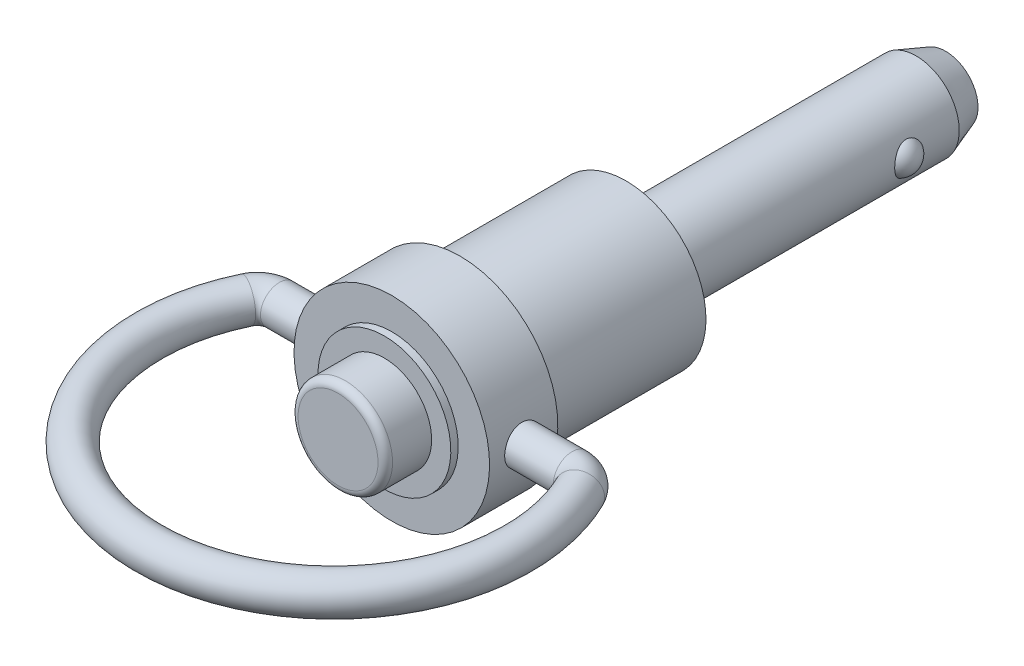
ISO-10303-21;
HEADER;
FILE_DESCRIPTION(('STEP AP214'),'2;1');
FILE_NAME('part.step','',(''),(''),'','','');
FILE_SCHEMA(('AUTOMOTIVE_DESIGN { 1 0 10303 214 1 1 1 1 }'));
ENDSEC;
DATA;
#1=APPLICATION_CONTEXT('core data for automotive mechanical design processes');
#2=APPLICATION_PROTOCOL_DEFINITION('international standard','automotive_design',2000,#1);
#3=PRODUCT_CONTEXT('',#1,'mechanical');
#4=PRODUCT('Part','Part','',(#3));
#5=PRODUCT_RELATED_PRODUCT_CATEGORY('part','',(#4));
#6=PRODUCT_DEFINITION_FORMATION('','',#4);
#7=PRODUCT_DEFINITION_CONTEXT('part definition',#1,'design');
#8=PRODUCT_DEFINITION('design','',#6,#7);
#9=PRODUCT_DEFINITION_SHAPE('','',#8);
#10=(LENGTH_UNIT() NAMED_UNIT(*) SI_UNIT(.MILLI.,.METRE.));
#11=(NAMED_UNIT(*) PLANE_ANGLE_UNIT() SI_UNIT($,.RADIAN.));
#12=(NAMED_UNIT(*) SI_UNIT($,.STERADIAN.) SOLID_ANGLE_UNIT());
#13=UNCERTAINTY_MEASURE_WITH_UNIT(LENGTH_MEASURE(1.E-05),#10,'distance_accuracy_value','');
#14=(GEOMETRIC_REPRESENTATION_CONTEXT(3) GLOBAL_UNCERTAINTY_ASSIGNED_CONTEXT((#13)) GLOBAL_UNIT_ASSIGNED_CONTEXT((#10,
#11,#12)) REPRESENTATION_CONTEXT('',''));
#15=CARTESIAN_POINT('',(0.,0.,0.));
#16=DIRECTION('',(0.,0.,1.));
#17=DIRECTION('',(1.,0.,0.));
#18=AXIS2_PLACEMENT_3D('',#15,#16,#17);
#19=CARTESIAN_POINT('',(0.,0.,20.828));
#20=DIRECTION('',(0.,0.,-1.));
#21=DIRECTION('',(0.,1.,0.));
#22=AXIS2_PLACEMENT_3D('',#19,#20,#21);
#23=CYLINDRICAL_SURFACE('',#22,3.2512);
#24=CARTESIAN_POINT('',(0.,0.,16.637));
#25=DIRECTION('',(0.,0.,-1.));
#26=DIRECTION('',(0.,1.,0.));
#27=AXIS2_PLACEMENT_3D('',#24,#25,#26);
#28=CIRCLE('',#27,3.2512);
#29=CARTESIAN_POINT('',(0.,3.2512,16.637));
#30=VERTEX_POINT('',#29);
#31=EDGE_CURVE('E30',#30,#30,#28,.T.);
#32=ORIENTED_EDGE('',*,*,#31,.F.);
#33=EDGE_LOOP('',(#32));
#34=FACE_BOUND('',#33,.T.);
#35=CARTESIAN_POINT('',(0.,0.,19.328));
#36=DIRECTION('',(0.,0.,1.));
#37=DIRECTION('',(1.,0.,0.));
#38=AXIS2_PLACEMENT_3D('',#35,#36,#37);
#39=CIRCLE('',#38,3.2512);
#40=CARTESIAN_POINT('',(3.2512,0.,19.328));
#41=VERTEX_POINT('',#40);
#42=EDGE_CURVE('E136',#41,#41,#39,.T.);
#43=ORIENTED_EDGE('',*,*,#42,.F.);
#44=EDGE_LOOP('',(#43));
#45=FACE_BOUND('',#44,.T.);
#46=ADVANCED_FACE('F12',(#34,#45),#23,.T.);
#47=CARTESIAN_POINT('',(4.572,0.,16.637));
#48=DIRECTION('',(0.,0.,1.));
#49=DIRECTION('',(0.,-1.,0.));
#50=AXIS2_PLACEMENT_3D('',#47,#48,#49);
#51=PLANE('',#50);
#52=ORIENTED_EDGE('',*,*,#31,.T.);
#53=EDGE_LOOP('',(#52));
#54=FACE_BOUND('',#53,.T.);
#55=CARTESIAN_POINT('',(0.,0.,16.637));
#56=DIRECTION('',(0.,0.,-1.));
#57=DIRECTION('',(0.,1.,0.));
#58=AXIS2_PLACEMENT_3D('',#55,#56,#57);
#59=CIRCLE('',#58,4.572);
#60=CARTESIAN_POINT('',(0.,4.572,16.637));
#61=VERTEX_POINT('',#60);
#62=EDGE_CURVE('E35',#61,#61,#59,.T.);
#63=ORIENTED_EDGE('',*,*,#62,.F.);
#64=EDGE_LOOP('',(#63));
#65=FACE_BOUND('',#64,.T.);
#66=ADVANCED_FACE('F78',(#54,#65),#51,.T.);
#67=CARTESIAN_POINT('',(0.,0.,0.));
#68=DIRECTION('',(0.,0.,-1.));
#69=DIRECTION('',(0.,1.,0.));
#70=AXIS2_PLACEMENT_3D('',#67,#68,#69);
#71=CYLINDRICAL_SURFACE('',#70,4.572);
#72=ORIENTED_EDGE('',*,*,#62,.T.);
#73=EDGE_LOOP('',(#72));
#74=FACE_BOUND('',#73,.T.);
#75=CARTESIAN_POINT('',(0.,0.,16.129));
#76=DIRECTION('',(0.,0.,-1.));
#77=DIRECTION('',(0.,1.,0.));
#78=AXIS2_PLACEMENT_3D('',#75,#76,#77);
#79=CIRCLE('',#78,4.572);
#80=CARTESIAN_POINT('',(0.,4.572,16.129));
#81=VERTEX_POINT('',#80);
#82=EDGE_CURVE('E38',#81,#81,#79,.T.);
#83=ORIENTED_EDGE('',*,*,#82,.F.);
#84=EDGE_LOOP('',(#83));
#85=FACE_BOUND('',#84,.T.);
#86=ADVANCED_FACE('F155',(#74,#85),#71,.T.);
#87=CARTESIAN_POINT('',(6.731,0.,16.129));
#88=DIRECTION('',(0.,0.,1.));
#89=DIRECTION('',(0.,-1.,0.));
#90=AXIS2_PLACEMENT_3D('',#87,#88,#89);
#91=PLANE('',#90);
#92=CARTESIAN_POINT('',(0.,0.,16.129));
#93=DIRECTION('',(0.,0.,-1.));
#94=DIRECTION('',(0.,1.,0.));
#95=AXIS2_PLACEMENT_3D('',#92,#93,#94);
#96=CIRCLE('',#95,6.731);
#97=CARTESIAN_POINT('',(0.,6.731,16.129));
#98=VERTEX_POINT('',#97);
#99=EDGE_CURVE('E41',#98,#98,#96,.T.);
#100=ORIENTED_EDGE('',*,*,#99,.F.);
#101=EDGE_LOOP('',(#100));
#102=FACE_BOUND('',#101,.T.);
#103=ORIENTED_EDGE('',*,*,#82,.T.);
#104=EDGE_LOOP('',(#103));
#105=FACE_BOUND('',#104,.T.);
#106=ADVANCED_FACE('F196',(#102,#105),#91,.T.);
#107=CARTESIAN_POINT('',(0.,0.,0.));
#108=DIRECTION('',(0.,0.,-1.));
#109=DIRECTION('',(0.,1.,0.));
#110=AXIS2_PLACEMENT_3D('',#107,#108,#109);
#111=CYLINDRICAL_SURFACE('',#110,6.731);
#112=CARTESIAN_POINT('',(0.,0.,11.43));
#113=DIRECTION('',(0.,0.,-1.));
#114=DIRECTION('',(0.,1.,0.));
#115=AXIS2_PLACEMENT_3D('',#112,#113,#114);
#116=CIRCLE('',#115,6.731);
#117=CARTESIAN_POINT('',(0.,6.731,11.43));
#118=VERTEX_POINT('',#117);
#119=EDGE_CURVE('E44',#118,#118,#116,.T.);
#120=ORIENTED_EDGE('',*,*,#119,.F.);
#121=EDGE_LOOP('',(#120));
#122=FACE_BOUND('',#121,.T.);
#123=ORIENTED_EDGE('',*,*,#99,.T.);
#124=EDGE_LOOP('',(#123));
#125=FACE_BOUND('',#124,.T.);
#126=CARTESIAN_POINT('',(-6.6051722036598,1.2954,13.7922));
#127=CARTESIAN_POINT('',(-6.60517361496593,1.2953972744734,13.864236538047));
#128=CARTESIAN_POINT('',(-6.60636346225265,1.28937073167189,13.9363080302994));
#129=CARTESIAN_POINT('',(-6.61098794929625,1.26544153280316,14.0784162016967));
#130=CARTESIAN_POINT('',(-6.61442445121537,1.24752902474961,14.1484511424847));
#131=CARTESIAN_POINT('',(-6.62313895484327,1.20040052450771,14.2844095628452));
#132=CARTESIAN_POINT('',(-6.62841519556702,1.17119533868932,14.3503369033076));
#133=CARTESIAN_POINT('',(-6.64021258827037,1.10233951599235,14.4763528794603));
#134=CARTESIAN_POINT('',(-6.64673365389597,1.06268960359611,14.5364419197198));
#135=CARTESIAN_POINT('',(-6.66038139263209,0.973516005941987,14.6498669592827));
#136=CARTESIAN_POINT('',(-6.66751428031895,0.9238817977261,14.7031153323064));
#137=CARTESIAN_POINT('',(-6.68152715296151,0.816387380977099,14.8005834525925));
#138=CARTESIAN_POINT('',(-6.6884071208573,0.758526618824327,14.8448025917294));
#139=CARTESIAN_POINT('',(-6.7012057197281,0.635644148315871,14.9232944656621));
#140=CARTESIAN_POINT('',(-6.70711617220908,0.570568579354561,14.9574843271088));
#141=CARTESIAN_POINT('',(-6.71724013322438,0.435464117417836,15.014412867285));
#142=CARTESIAN_POINT('',(-6.72145378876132,0.365435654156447,15.0371525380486));
#143=CARTESIAN_POINT('',(-6.72766549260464,0.223321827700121,15.0702635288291));
#144=CARTESIAN_POINT('',(-6.72968999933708,0.151272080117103,15.0807826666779));
#145=CARTESIAN_POINT('',(-6.73138656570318,0.00640388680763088,15.089614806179));
#146=CARTESIAN_POINT('',(-6.73105883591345,-0.0664144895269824,15.0879289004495));
#147=CARTESIAN_POINT('',(-6.72810846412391,-0.209738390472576,15.072511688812));
#148=CARTESIAN_POINT('',(-6.72551615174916,-0.280261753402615,15.0589395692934));
#149=CARTESIAN_POINT('',(-6.71836197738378,-0.418011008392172,15.0203872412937));
#150=CARTESIAN_POINT('',(-6.71380004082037,-0.485236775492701,14.9954066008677));
#151=CARTESIAN_POINT('',(-6.70316878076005,-0.614941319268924,14.9345963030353));
#152=CARTESIAN_POINT('',(-6.69709072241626,-0.67738974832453,14.8987035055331));
#153=CARTESIAN_POINT('',(-6.68409856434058,-0.795436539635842,14.8171343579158));
#154=CARTESIAN_POINT('',(-6.677184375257,-0.851034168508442,14.7714569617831));
#155=CARTESIAN_POINT('',(-6.66315320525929,-0.954744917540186,14.6707395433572));
#156=CARTESIAN_POINT('',(-6.65603475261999,-1.00272266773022,14.6155602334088));
#157=CARTESIAN_POINT('',(-6.64250376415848,-1.08876420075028,14.4978679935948));
#158=CARTESIAN_POINT('',(-6.63609123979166,-1.12682782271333,14.4353549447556));
#159=CARTESIAN_POINT('',(-6.62469571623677,-1.19200234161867,14.3045844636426));
#160=CARTESIAN_POINT('',(-6.61971540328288,-1.21909269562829,14.2363165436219));
#161=CARTESIAN_POINT('',(-6.61178862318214,-1.26138008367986,14.0960804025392));
#162=CARTESIAN_POINT('',(-6.60884191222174,-1.27657854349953,14.0241126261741));
#163=CARTESIAN_POINT('',(-6.60536444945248,-1.29445125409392,13.8797427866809));
#164=CARTESIAN_POINT('',(-6.60479610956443,-1.29732037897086,13.8073657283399));
#165=CARTESIAN_POINT('',(-6.60603903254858,-1.29097613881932,13.6631669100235));
#166=CARTESIAN_POINT('',(-6.60785017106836,-1.28176340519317,13.5913451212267));
#167=CARTESIAN_POINT('',(-6.6136128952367,-1.25168453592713,13.4509418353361));
#168=CARTESIAN_POINT('',(-6.61754556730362,-1.23092132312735,13.3823374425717));
#169=CARTESIAN_POINT('',(-6.62709183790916,-1.17844042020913,13.249581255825));
#170=CARTESIAN_POINT('',(-6.63270556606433,-1.14672188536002,13.1854298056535));
#171=CARTESIAN_POINT('',(-6.6450665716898,-1.07278507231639,13.0625442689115));
#172=CARTESIAN_POINT('',(-6.65182676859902,-1.03044414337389,13.0038853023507));
#173=CARTESIAN_POINT('',(-6.66568301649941,-0.936629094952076,12.8944341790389));
#174=CARTESIAN_POINT('',(-6.67277909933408,-0.885154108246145,12.8436427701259));
#175=CARTESIAN_POINT('',(-6.68662882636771,-0.773660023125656,12.7506362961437));
#176=CARTESIAN_POINT('',(-6.69337621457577,-0.713530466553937,12.7085525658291));
#177=CARTESIAN_POINT('',(-6.70566168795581,-0.586941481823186,12.6350847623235));
#178=CARTESIAN_POINT('',(-6.71119982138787,-0.520482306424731,12.6037002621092));
#179=CARTESIAN_POINT('',(-6.72041595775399,-0.383476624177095,12.5527164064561));
#180=CARTESIAN_POINT('',(-6.72410395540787,-0.312954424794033,12.5330536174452));
#181=CARTESIAN_POINT('',(-6.72924701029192,-0.169530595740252,12.5058694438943));
#182=CARTESIAN_POINT('',(-6.7307023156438,-0.0966292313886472,12.4983467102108));
#183=CARTESIAN_POINT('',(-6.73121071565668,0.0482259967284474,12.4957052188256));
#184=CARTESIAN_POINT('',(-6.73030215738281,0.120176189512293,12.5003884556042));
#185=CARTESIAN_POINT('',(-6.72626496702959,0.26224403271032,12.5215909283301));
#186=CARTESIAN_POINT('',(-6.72313635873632,0.332361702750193,12.5381100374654));
#187=CARTESIAN_POINT('',(-6.71501101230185,0.468662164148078,12.5824301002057));
#188=CARTESIAN_POINT('',(-6.710017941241,0.534852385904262,12.6102089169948));
#189=CARTESIAN_POINT('',(-6.69870305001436,0.661661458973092,12.6762356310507));
#190=CARTESIAN_POINT('',(-6.69238113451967,0.722279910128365,12.7144842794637));
#191=CARTESIAN_POINT('',(-6.6789853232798,0.837208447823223,12.8010411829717));
#192=CARTESIAN_POINT('',(-6.67190155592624,0.891410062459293,12.8494919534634));
#193=CARTESIAN_POINT('',(-6.65784127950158,0.990982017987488,12.95478313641));
#194=CARTESIAN_POINT('',(-6.65086479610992,1.03635027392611,13.0116255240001));
#195=CARTESIAN_POINT('',(-6.63773378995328,1.11738877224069,13.1327559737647));
#196=CARTESIAN_POINT('',(-6.63158802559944,1.15295925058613,13.1971117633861));
#197=CARTESIAN_POINT('',(-6.62092027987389,1.21272619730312,13.3309847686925));
#198=CARTESIAN_POINT('',(-6.61639678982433,1.23693323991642,13.4004971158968));
#199=CARTESIAN_POINT('',(-6.61041337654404,1.26845390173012,13.5238636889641));
#200=CARTESIAN_POINT('',(-6.60845980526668,1.27854107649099,13.57700269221));
#201=CARTESIAN_POINT('',(-6.60583870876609,1.29201504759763,13.6841545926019));
#202=CARTESIAN_POINT('',(-6.60517114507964,1.29540204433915,13.7381674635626));
#203=CARTESIAN_POINT('',(-6.6051722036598,1.2954,13.7922));
#204=B_SPLINE_CURVE_WITH_KNOTS('',3,(#126,#127,#128,#129,#130,#131,#132,#133,#134,#135,#136,
#137,#138,#139,#140,#141,#142,#143,#144,#145,#146,#147,#148,#149,#150,#151,#152,#153,#154,#155,
#156,#157,#158,#159,#160,#161,#162,#163,#164,#165,#166,#167,#168,#169,#170,#171,#172,#173,#174,
#175,#176,#177,#178,#179,#180,#181,#182,#183,#184,#185,#186,#187,#188,#189,#190,#191,#192,#193,
#194,#195,#196,#197,#198,#199,#200,#201,#202,#203),.UNSPECIFIED.,.T.,.F.,(4,2,2,2,2,2,2,2,2,2,2,
2,2,2,2,2,2,2,2,2,2,2,2,2,2,2,2,2,2,2,2,2,2,2,2,2,2,2,4),(0.,0.215911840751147,
0.432002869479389,0.64788762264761,0.86375740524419,1.08216318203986,1.30058366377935,
1.52076118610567,1.74091962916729,1.95838638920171,2.1758336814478,2.39041258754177,
2.60499961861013,2.82085272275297,3.0367289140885,3.25609136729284,3.47545737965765,
3.69523218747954,3.91498064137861,4.13124273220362,4.34749352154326,4.56184753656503,
4.7762180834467,4.99318797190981,5.21017847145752,5.430235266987,5.65028327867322,
5.86912939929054,6.08795119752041,6.30324544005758,6.51853737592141,6.73340808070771,
6.94829420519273,7.16640910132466,7.38457541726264,7.60488731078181,7.82499378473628,
7.9869478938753,8.14889715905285),.UNSPECIFIED.);
#205=CARTESIAN_POINT('',(-6.6051722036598,1.2954,13.7922));
#206=VERTEX_POINT('',#205);
#207=EDGE_CURVE('E27',#206,#206,#204,.T.);
#208=ORIENTED_EDGE('',*,*,#207,.T.);
#209=EDGE_LOOP('',(#208));
#210=FACE_BOUND('',#209,.T.);
#211=CARTESIAN_POINT('',(6.6051722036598,1.2954,13.7922));
#212=CARTESIAN_POINT('',(6.60517361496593,1.2953972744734,13.720163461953));
#213=CARTESIAN_POINT('',(6.60636346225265,1.2893707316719,13.6480919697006));
#214=CARTESIAN_POINT('',(6.61098794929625,1.26544153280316,13.5059837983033));
#215=CARTESIAN_POINT('',(6.61442445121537,1.24752902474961,13.4359488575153));
#216=CARTESIAN_POINT('',(6.62313895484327,1.20040052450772,13.2999904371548));
#217=CARTESIAN_POINT('',(6.62841519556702,1.17119533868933,13.2340630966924));
#218=CARTESIAN_POINT('',(6.64021258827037,1.10233951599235,13.1080471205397));
#219=CARTESIAN_POINT('',(6.64673365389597,1.06268960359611,13.0479580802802));
#220=CARTESIAN_POINT('',(6.66038139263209,0.973516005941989,12.9345330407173));
#221=CARTESIAN_POINT('',(6.66751428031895,0.923881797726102,12.8812846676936));
#222=CARTESIAN_POINT('',(6.68152715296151,0.816387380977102,12.7838165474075));
#223=CARTESIAN_POINT('',(6.6884071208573,0.758526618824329,12.7395974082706));
#224=CARTESIAN_POINT('',(6.7012057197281,0.635644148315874,12.6611055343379));
#225=CARTESIAN_POINT('',(6.70711617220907,0.570568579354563,12.6269156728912));
#226=CARTESIAN_POINT('',(6.71724013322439,0.435464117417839,12.569987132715));
#227=CARTESIAN_POINT('',(6.72145378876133,0.36543565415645,12.5472474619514));
#228=CARTESIAN_POINT('',(6.72766549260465,0.223321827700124,12.5141364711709));
#229=CARTESIAN_POINT('',(6.72968999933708,0.151272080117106,12.5036173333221));
#230=CARTESIAN_POINT('',(6.73138656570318,0.00640388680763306,12.494785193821));
#231=CARTESIAN_POINT('',(6.73105883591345,-0.0664144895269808,12.4964710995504));
#232=CARTESIAN_POINT('',(6.72810846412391,-0.209738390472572,12.511888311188));
#233=CARTESIAN_POINT('',(6.72551615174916,-0.280261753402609,12.5254604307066));
#234=CARTESIAN_POINT('',(6.71836197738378,-0.418011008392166,12.5640127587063));
#235=CARTESIAN_POINT('',(6.71380004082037,-0.4852367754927,12.5889933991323));
#236=CARTESIAN_POINT('',(6.70316878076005,-0.614941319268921,12.6498036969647));
#237=CARTESIAN_POINT('',(6.69709072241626,-0.67738974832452,12.6856964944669));
#238=CARTESIAN_POINT('',(6.68409856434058,-0.795436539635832,12.7672656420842));
#239=CARTESIAN_POINT('',(6.677184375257,-0.851034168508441,12.8129430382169));
#240=CARTESIAN_POINT('',(6.66315320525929,-0.954744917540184,12.9136604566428));
#241=CARTESIAN_POINT('',(6.65603475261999,-1.00272266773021,12.9688397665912));
#242=CARTESIAN_POINT('',(6.64250376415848,-1.08876420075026,13.0865320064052));
#243=CARTESIAN_POINT('',(6.63609123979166,-1.12682782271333,13.1490450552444));
#244=CARTESIAN_POINT('',(6.62469571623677,-1.19200234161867,13.2798155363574));
#245=CARTESIAN_POINT('',(6.61971540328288,-1.21909269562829,13.3480834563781));
#246=CARTESIAN_POINT('',(6.61178862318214,-1.26138008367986,13.4883195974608));
#247=CARTESIAN_POINT('',(6.60884191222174,-1.27657854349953,13.5602873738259));
#248=CARTESIAN_POINT('',(6.60536444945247,-1.29445125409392,13.7046572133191));
#249=CARTESIAN_POINT('',(6.60479610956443,-1.29732037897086,13.7770342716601));
#250=CARTESIAN_POINT('',(6.60603903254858,-1.29097613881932,13.9212330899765));
#251=CARTESIAN_POINT('',(6.60785017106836,-1.28176340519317,13.9930548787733));
#252=CARTESIAN_POINT('',(6.6136128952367,-1.25168453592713,14.1334581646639));
#253=CARTESIAN_POINT('',(6.61754556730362,-1.23092132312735,14.2020625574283));
#254=CARTESIAN_POINT('',(6.62709183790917,-1.17844042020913,14.334818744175));
#255=CARTESIAN_POINT('',(6.63270556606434,-1.14672188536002,14.3989701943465));
#256=CARTESIAN_POINT('',(6.64506657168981,-1.07278507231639,14.5218557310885));
#257=CARTESIAN_POINT('',(6.65182676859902,-1.03044414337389,14.5805146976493));
#258=CARTESIAN_POINT('',(6.66568301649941,-0.936629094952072,14.6899658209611));
#259=CARTESIAN_POINT('',(6.67277909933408,-0.885154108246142,14.7407572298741));
#260=CARTESIAN_POINT('',(6.68662882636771,-0.773660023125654,14.8337637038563));
#261=CARTESIAN_POINT('',(6.69337621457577,-0.713530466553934,14.8758474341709));
#262=CARTESIAN_POINT('',(6.70566168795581,-0.586941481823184,14.9493152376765));
#263=CARTESIAN_POINT('',(6.71119982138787,-0.520482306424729,14.9806997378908));
#264=CARTESIAN_POINT('',(6.72041595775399,-0.383476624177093,15.0316835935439));
#265=CARTESIAN_POINT('',(6.72410395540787,-0.31295442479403,15.0513463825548));
#266=CARTESIAN_POINT('',(6.72924701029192,-0.169530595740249,15.0785305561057));
#267=CARTESIAN_POINT('',(6.7307023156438,-0.0966292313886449,15.0860532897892));
#268=CARTESIAN_POINT('',(6.73121071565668,0.0482259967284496,15.0886947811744));
#269=CARTESIAN_POINT('',(6.73030215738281,0.120176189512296,15.0840115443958));
#270=CARTESIAN_POINT('',(6.72626496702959,0.262244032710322,15.0628090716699));
#271=CARTESIAN_POINT('',(6.72313635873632,0.332361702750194,15.0462899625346));
#272=CARTESIAN_POINT('',(6.71501101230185,0.46866216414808,15.0019698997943));
#273=CARTESIAN_POINT('',(6.710017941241,0.534852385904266,14.9741910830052));
#274=CARTESIAN_POINT('',(6.69870305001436,0.661661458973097,14.9081643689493));
#275=CARTESIAN_POINT('',(6.69238113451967,0.722279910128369,14.8699157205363));
#276=CARTESIAN_POINT('',(6.6789853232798,0.837208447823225,14.7833588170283));
#277=CARTESIAN_POINT('',(6.67190155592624,0.891410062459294,14.7349080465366));
#278=CARTESIAN_POINT('',(6.65784127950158,0.990982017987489,14.62961686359));
#279=CARTESIAN_POINT('',(6.65086479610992,1.03635027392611,14.5727744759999));
#280=CARTESIAN_POINT('',(6.63773378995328,1.1173887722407,14.4516440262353));
#281=CARTESIAN_POINT('',(6.63158802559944,1.15295925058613,14.3872882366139));
#282=CARTESIAN_POINT('',(6.62092027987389,1.21272619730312,14.2534152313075));
#283=CARTESIAN_POINT('',(6.61639678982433,1.23693323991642,14.1839028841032));
#284=CARTESIAN_POINT('',(6.61041337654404,1.26845390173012,14.0605363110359));
#285=CARTESIAN_POINT('',(6.60845980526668,1.27854107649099,14.00739730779));
#286=CARTESIAN_POINT('',(6.60583870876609,1.29201504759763,13.9002454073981));
#287=CARTESIAN_POINT('',(6.60517114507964,1.29540204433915,13.8462325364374));
#288=CARTESIAN_POINT('',(6.6051722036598,1.2954,13.7922));
#289=B_SPLINE_CURVE_WITH_KNOTS('',3,(#211,#212,#213,#214,#215,#216,#217,#218,#219,#220,#221,
#222,#223,#224,#225,#226,#227,#228,#229,#230,#231,#232,#233,#234,#235,#236,#237,#238,#239,#240,
#241,#242,#243,#244,#245,#246,#247,#248,#249,#250,#251,#252,#253,#254,#255,#256,#257,#258,#259,
#260,#261,#262,#263,#264,#265,#266,#267,#268,#269,#270,#271,#272,#273,#274,#275,#276,#277,#278,
#279,#280,#281,#282,#283,#284,#285,#286,#287,#288),.UNSPECIFIED.,.T.,.F.,(4,2,2,2,2,2,2,2,2,2,2,
2,2,2,2,2,2,2,2,2,2,2,2,2,2,2,2,2,2,2,2,2,2,2,2,2,2,2,4),(0.,0.215911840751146,
0.432002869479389,0.64788762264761,0.86375740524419,1.08216318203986,1.30058366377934,
1.52076118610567,1.74091962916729,1.95838638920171,2.1758336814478,2.39041258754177,
2.60499961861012,2.82085272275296,3.0367289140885,3.25609136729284,3.47545737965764,
3.69523218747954,3.91498064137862,4.13124273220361,4.34749352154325,4.56184753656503,
4.77621808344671,4.99318797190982,5.21017847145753,5.43023526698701,5.65028327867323,
5.86912939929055,6.08795119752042,6.30324544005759,6.51853737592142,6.73340808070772,
6.94829420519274,7.16640910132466,7.38457541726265,7.60488731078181,7.82499378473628,
7.98694789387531,8.14889715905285),.UNSPECIFIED.);
#290=CARTESIAN_POINT('',(6.6051722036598,1.2954,13.7922));
#291=VERTEX_POINT('',#290);
#292=EDGE_CURVE('E23',#291,#291,#289,.T.);
#293=ORIENTED_EDGE('',*,*,#292,.T.);
#294=EDGE_LOOP('',(#293));
#295=FACE_BOUND('',#294,.T.);
#296=ADVANCED_FACE('F147',(#122,#125,#210,#295),#111,.T.);
#297=CARTESIAN_POINT('',(5.7785,0.,11.43));
#298=DIRECTION('',(0.,0.,-1.));
#299=DIRECTION('',(0.,1.,0.));
#300=AXIS2_PLACEMENT_3D('',#297,#298,#299);
#301=PLANE('',#300);
#302=CARTESIAN_POINT('',(0.,0.,11.43));
#303=DIRECTION('',(0.,0.,-1.));
#304=DIRECTION('',(0.,1.,0.));
#305=AXIS2_PLACEMENT_3D('',#302,#303,#304);
#306=CIRCLE('',#305,5.9);
#307=CARTESIAN_POINT('',(0.,5.9,11.43));
#308=VERTEX_POINT('',#307);
#309=EDGE_CURVE('E19',#308,#308,#306,.F.);
#310=ORIENTED_EDGE('',*,*,#309,.T.);
#311=EDGE_LOOP('',(#310));
#312=FACE_BOUND('',#311,.T.);
#313=ORIENTED_EDGE('',*,*,#119,.T.);
#314=EDGE_LOOP('',(#313));
#315=FACE_BOUND('',#314,.T.);
#316=ADVANCED_FACE('F141',(#312,#315),#301,.T.);
#317=CARTESIAN_POINT('',(10.0803124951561,0.,15.3162));
#318=DIRECTION('',(0.,1.,0.));
#319=DIRECTION('',(-1.,0.,0.));
#320=AXIS2_PLACEMENT_3D('',#317,#318,#319);
#321=TOROIDAL_SURFACE('',#320,1.524,1.2954);
#322=CARTESIAN_POINT('',(11.4549005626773,0.,14.658109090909));
#323=DIRECTION('',(-0.431818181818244,0.,-0.901960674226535));
#324=DIRECTION('',(0.901960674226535,0.,-0.431818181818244));
#325=AXIS2_PLACEMENT_3D('',#322,#323,#324);
#326=CIRCLE('',#325,1.2954);
#327=CARTESIAN_POINT('',(12.6233004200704,0.,14.0987318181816));
#328=VERTEX_POINT('',#327);
#329=EDGE_CURVE('E48',#328,#328,#326,.T.);
#330=ORIENTED_EDGE('',*,*,#329,.T.);
#331=EDGE_LOOP('',(#330));
#332=FACE_BOUND('',#331,.T.);
#333=CARTESIAN_POINT('',(10.0803124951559,0.,13.7922));
#334=DIRECTION('',(1.,0.,0.));
#335=DIRECTION('',(0.,1.,0.));
#336=AXIS2_PLACEMENT_3D('',#333,#334,#335);
#337=CIRCLE('',#336,1.2954);
#338=CARTESIAN_POINT('',(10.0803124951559,1.2954,13.7922));
#339=VERTEX_POINT('',#338);
#340=EDGE_CURVE('E34',#339,#339,#337,.F.);
#341=ORIENTED_EDGE('',*,*,#340,.F.);
#342=EDGE_LOOP('',(#341));
#343=FACE_BOUND('',#342,.T.);
#344=ADVANCED_FACE('F76',(#332,#343),#321,.T.);
#345=CARTESIAN_POINT('',(-10.0803124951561,0.,13.7922));
#346=DIRECTION('',(1.,0.,0.));
#347=DIRECTION('',(0.,1.,0.));
#348=AXIS2_PLACEMENT_3D('',#345,#346,#347);
#349=CYLINDRICAL_SURFACE('',#348,1.2954);
#350=ORIENTED_EDGE('',*,*,#292,.F.);
#351=EDGE_LOOP('',(#350));
#352=FACE_BOUND('',#351,.T.);
#353=ORIENTED_EDGE('',*,*,#340,.T.);
#354=EDGE_LOOP('',(#353));
#355=FACE_BOUND('',#354,.T.);
#356=ADVANCED_FACE('F72',(#352,#355),#349,.T.);
#357=CARTESIAN_POINT('',(0.,0.,20.1422));
#358=DIRECTION('',(0.,1.,0.));
#359=DIRECTION('',(-1.,0.,0.));
#360=AXIS2_PLACEMENT_3D('',#357,#358,#359);
#361=TOROIDAL_SURFACE('',#360,12.7,1.2954);
#362=CARTESIAN_POINT('',(-11.4549005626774,0.,14.6581090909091));
#363=DIRECTION('',(-0.43181818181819,0.,0.901960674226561));
#364=DIRECTION('',(-0.901960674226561,0.,-0.43181818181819));
#365=AXIS2_PLACEMENT_3D('',#362,#363,#364);
#366=CIRCLE('',#365,1.2954);
#367=CARTESIAN_POINT('',(-12.6233004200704,0.,14.0987318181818));
#368=VERTEX_POINT('',#367);
#369=EDGE_CURVE('E51',#368,#368,#366,.F.);
#370=ORIENTED_EDGE('',*,*,#369,.F.);
#371=EDGE_LOOP('',(#370));
#372=FACE_BOUND('',#371,.T.);
#373=ORIENTED_EDGE('',*,*,#329,.F.);
#374=EDGE_LOOP('',(#373));
#375=FACE_BOUND('',#374,.T.);
#376=ADVANCED_FACE('F69',(#372,#375),#361,.T.);
#377=CARTESIAN_POINT('',(-10.0803124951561,0.,15.3162));
#378=DIRECTION('',(0.,1.,0.));
#379=DIRECTION('',(-1.,0.,0.));
#380=AXIS2_PLACEMENT_3D('',#377,#378,#379);
#381=TOROIDAL_SURFACE('',#380,1.524,1.2954);
#382=CARTESIAN_POINT('',(-10.0803124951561,0.,13.7922));
#383=DIRECTION('',(1.,0.,0.));
#384=DIRECTION('',(0.,1.,0.));
#385=AXIS2_PLACEMENT_3D('',#382,#383,#384);
#386=CIRCLE('',#385,1.2954);
#387=CARTESIAN_POINT('',(-10.0803124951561,1.2954,13.7922));
#388=VERTEX_POINT('',#387);
#389=EDGE_CURVE('E33',#388,#388,#386,.T.);
#390=ORIENTED_EDGE('',*,*,#389,.F.);
#391=EDGE_LOOP('',(#390));
#392=FACE_BOUND('',#391,.T.);
#393=ORIENTED_EDGE('',*,*,#369,.T.);
#394=EDGE_LOOP('',(#393));
#395=FACE_BOUND('',#394,.T.);
#396=ADVANCED_FACE('F64',(#392,#395),#381,.T.);
#397=CARTESIAN_POINT('',(-10.0803124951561,0.,13.7922));
#398=DIRECTION('',(1.,0.,0.));
#399=DIRECTION('',(0.,1.,0.));
#400=AXIS2_PLACEMENT_3D('',#397,#398,#399);
#401=CYLINDRICAL_SURFACE('',#400,1.2954);
#402=ORIENTED_EDGE('',*,*,#207,.F.);
#403=EDGE_LOOP('',(#402));
#404=FACE_BOUND('',#403,.T.);
#405=ORIENTED_EDGE('',*,*,#389,.T.);
#406=EDGE_LOOP('',(#405));
#407=FACE_BOUND('',#406,.T.);
#408=ADVANCED_FACE('F68',(#404,#407),#401,.T.);
#409=CARTESIAN_POINT('',(0.,0.,19.328));
#410=DIRECTION('',(0.,0.,1.));
#411=DIRECTION('',(1.,0.,0.));
#412=AXIS2_PLACEMENT_3D('',#409,#410,#411);
#413=TOROIDAL_SURFACE('',#412,2.7512,0.5);
#414=CARTESIAN_POINT('',(0.,0.,19.828));
#415=DIRECTION('',(0.,0.,1.));
#416=DIRECTION('',(1.,0.,0.));
#417=AXIS2_PLACEMENT_3D('',#414,#415,#416);
#418=CIRCLE('',#417,2.7512);
#419=CARTESIAN_POINT('',(2.7512,0.,19.828));
#420=VERTEX_POINT('',#419);
#421=EDGE_CURVE('E162',#420,#420,#418,.T.);
#422=ORIENTED_EDGE('',*,*,#421,.F.);
#423=EDGE_LOOP('',(#422));
#424=FACE_BOUND('',#423,.T.);
#425=ORIENTED_EDGE('',*,*,#42,.T.);
#426=EDGE_LOOP('',(#425));
#427=FACE_BOUND('',#426,.T.);
#428=ADVANCED_FACE('F94',(#424,#427),#413,.T.);
#429=CARTESIAN_POINT('',(0.,0.,19.828));
#430=DIRECTION('',(0.,0.,-1.));
#431=DIRECTION('',(-1.,0.,0.));
#432=AXIS2_PLACEMENT_3D('',#429,#430,#431);
#433=PLANE('',#432);
#434=ORIENTED_EDGE('',*,*,#421,.T.);
#435=EDGE_LOOP('',(#434));
#436=FACE_BOUND('',#435,.T.);
#437=ADVANCED_FACE('F173',(#436),#433,.F.);
#438=CARTESIAN_POINT('',(0.,0.,44.6321753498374));
#439=DIRECTION('',(0.,0.,-1.));
#440=DIRECTION('',(0.,1.,0.));
#441=AXIS2_PLACEMENT_3D('',#438,#439,#440);
#442=CYLINDRICAL_SURFACE('',#441,5.5);
#443=CARTESIAN_POINT('',(0.,0.,11.03));
#444=DIRECTION('',(0.,0.,-1.));
#445=DIRECTION('',(0.,1.,0.));
#446=AXIS2_PLACEMENT_3D('',#443,#444,#445);
#447=CIRCLE('',#446,5.5);
#448=CARTESIAN_POINT('',(0.,5.5,11.03));
#449=VERTEX_POINT('',#448);
#450=EDGE_CURVE('E8',#449,#449,#447,.T.);
#451=ORIENTED_EDGE('',*,*,#450,.T.);
#452=EDGE_LOOP('',(#451));
#453=FACE_BOUND('',#452,.T.);
#454=CARTESIAN_POINT('',(0.,0.,0.));
#455=DIRECTION('',(0.,0.,-1.));
#456=DIRECTION('',(0.,1.,0.));
#457=AXIS2_PLACEMENT_3D('',#454,#455,#456);
#458=CIRCLE('',#457,5.5);
#459=CARTESIAN_POINT('',(0.,5.5,0.));
#460=VERTEX_POINT('',#459);
#461=EDGE_CURVE('E164',#460,#460,#458,.T.);
#462=ORIENTED_EDGE('',*,*,#461,.F.);
#463=EDGE_LOOP('',(#462));
#464=FACE_BOUND('',#463,.T.);
#465=ADVANCED_FACE('F101',(#453,#464),#442,.T.);
#466=CARTESIAN_POINT('',(2.23030748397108,0.,-21.9964));
#467=DIRECTION('',(0.,0.,1.));
#468=DIRECTION('',(0.,-1.,0.));
#469=AXIS2_PLACEMENT_3D('',#466,#467,#468);
#470=PLANE('',#469);
#471=CARTESIAN_POINT('',(0.,0.,-21.9963999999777));
#472=DIRECTION('',(0.,0.,1.));
#473=DIRECTION('',(0.,-1.,0.));
#474=AXIS2_PLACEMENT_3D('',#471,#472,#473);
#475=CIRCLE('',#474,2.23030748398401);
#476=CARTESIAN_POINT('',(0.,-2.23030748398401,-21.9963999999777));
#477=VERTEX_POINT('',#476);
#478=EDGE_CURVE('E134',#477,#477,#475,.T.);
#479=ORIENTED_EDGE('',*,*,#478,.F.);
#480=EDGE_LOOP('',(#479));
#481=FACE_BOUND('',#480,.T.);
#482=ADVANCED_FACE('F96',(#481),#470,.F.);
#483=CARTESIAN_POINT('',(2.304415,0.,-16.51));
#484=DIRECTION('',(0.,0.,1.));
#485=DIRECTION('',(1.,0.,0.));
#486=AXIS2_PLACEMENT_3D('',#483,#484,#485);
#487=SPHERICAL_SURFACE('',#486,1.190625);
#488=CARTESIAN_POINT('',(2.969895,0.,-15.5227187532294));
#489=CARTESIAN_POINT('',(2.96989215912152,0.0648797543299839,-15.5227204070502));
#490=CARTESIAN_POINT('',(2.9677488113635,0.129813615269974,-15.5276893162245));
#491=CARTESIAN_POINT('',(2.95937088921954,0.257945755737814,-15.547546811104));
#492=CARTESIAN_POINT('',(2.95313050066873,0.321141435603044,-15.5624494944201));
#493=CARTESIAN_POINT('',(2.93717671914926,0.443963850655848,-15.6020770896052));
#494=CARTESIAN_POINT('',(2.927461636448,0.503588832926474,-15.6268067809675));
#495=CARTESIAN_POINT('',(2.90558938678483,0.617402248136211,-15.6858521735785));
#496=CARTESIAN_POINT('',(2.89343280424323,0.671591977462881,-15.7201655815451));
#497=CARTESIAN_POINT('',(2.86839420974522,0.771479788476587,-15.79700516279));
#498=CARTESIAN_POINT('',(2.85553685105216,0.817351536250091,-15.8393126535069));
#499=CARTESIAN_POINT('',(2.83044802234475,0.900403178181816,-15.9319248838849));
#500=CARTESIAN_POINT('',(2.81821622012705,0.937587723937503,-15.9822253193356));
#501=CARTESIAN_POINT('',(2.79710280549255,0.998724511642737,-16.084854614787));
#502=CARTESIAN_POINT('',(2.78802161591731,1.02355036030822,-16.1366201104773));
#503=CARTESIAN_POINT('',(2.77310306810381,1.06331271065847,-16.2442484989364));
#504=CARTESIAN_POINT('',(2.76726231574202,1.07825956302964,-16.3001070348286));
#505=CARTESIAN_POINT('',(2.76014564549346,1.09633656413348,-16.4072555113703));
#506=CARTESIAN_POINT('',(2.75841717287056,1.10064055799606,-16.4583195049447));
#507=CARTESIAN_POINT('',(2.75839177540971,1.10070545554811,-16.5604466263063));
#508=CARTESIAN_POINT('',(2.76009369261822,1.09646924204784,-16.6115097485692));
#509=CARTESIAN_POINT('',(2.76652257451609,1.08013788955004,-16.7091717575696));
#510=CARTESIAN_POINT('',(2.77107366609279,1.0684990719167,-16.7558600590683));
#511=CARTESIAN_POINT('',(2.78254175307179,1.038266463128,-16.8466097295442));
#512=CARTESIAN_POINT('',(2.78945904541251,1.01967179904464,-16.8906707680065));
#513=CARTESIAN_POINT('',(2.80531085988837,0.975235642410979,-16.9770453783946));
#514=CARTESIAN_POINT('',(2.81431949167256,0.949116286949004,-17.0192017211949));
#515=CARTESIAN_POINT('',(2.83329926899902,0.890858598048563,-17.0988701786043));
#516=CARTESIAN_POINT('',(2.84327072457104,0.858718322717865,-17.1363807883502));
#517=CARTESIAN_POINT('',(2.86435381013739,0.785708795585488,-17.2098499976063));
#518=CARTESIAN_POINT('',(2.87547704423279,0.744281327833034,-17.2452503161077));
#519=CARTESIAN_POINT('',(2.89682125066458,0.656317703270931,-17.3093556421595));
#520=CARTESIAN_POINT('',(2.90704166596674,0.609778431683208,-17.3380565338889));
#521=CARTESIAN_POINT('',(2.92666236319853,0.507820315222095,-17.391048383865));
#522=CARTESIAN_POINT('',(2.93587462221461,0.451979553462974,-17.4145978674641));
#523=CARTESIAN_POINT('',(2.95127580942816,0.337048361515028,-17.4530177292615));
#524=CARTESIAN_POINT('',(2.95746769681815,0.27796117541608,-17.4678966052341));
#525=CARTESIAN_POINT('',(2.96452684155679,0.182100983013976,-17.4846891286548));
#526=CARTESIAN_POINT('',(2.96653354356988,0.145876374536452,-17.4894090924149));
#527=CARTESIAN_POINT('',(2.96921843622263,0.0731069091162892,-17.4957056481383));
#528=CARTESIAN_POINT('',(2.9698966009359,0.036562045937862,-17.4972821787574));
#529=CARTESIAN_POINT('',(2.96989215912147,-0.064879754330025,-17.4972795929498));
#530=CARTESIAN_POINT('',(2.96774881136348,-0.129813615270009,-17.4923106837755));
#531=CARTESIAN_POINT('',(2.95937088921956,-0.257945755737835,-17.472453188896));
#532=CARTESIAN_POINT('',(2.95313050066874,-0.321141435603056,-17.4575505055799));
#533=CARTESIAN_POINT('',(2.93717671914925,-0.443963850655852,-17.4179229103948));
#534=CARTESIAN_POINT('',(2.927461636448,-0.503588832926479,-17.3931932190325));
#535=CARTESIAN_POINT('',(2.90558938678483,-0.617402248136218,-17.3341478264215));
#536=CARTESIAN_POINT('',(2.89343280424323,-0.671591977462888,-17.2998344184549));
#537=CARTESIAN_POINT('',(2.86839420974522,-0.771479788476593,-17.22299483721));
#538=CARTESIAN_POINT('',(2.85553685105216,-0.817351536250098,-17.1806873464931));
#539=CARTESIAN_POINT('',(2.83044802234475,-0.900403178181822,-17.0880751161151));
#540=CARTESIAN_POINT('',(2.81821622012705,-0.937587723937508,-17.0377746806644));
#541=CARTESIAN_POINT('',(2.79710280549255,-0.998724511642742,-16.935145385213));
#542=CARTESIAN_POINT('',(2.78802161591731,-1.02355036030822,-16.8833798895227));
#543=CARTESIAN_POINT('',(2.77310306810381,-1.06331271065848,-16.7757515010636));
#544=CARTESIAN_POINT('',(2.76726231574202,-1.07825956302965,-16.7198929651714));
#545=CARTESIAN_POINT('',(2.76014564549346,-1.09633656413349,-16.6127444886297));
#546=CARTESIAN_POINT('',(2.75841717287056,-1.10064055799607,-16.5616804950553));
#547=CARTESIAN_POINT('',(2.75839177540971,-1.10070545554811,-16.4595533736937));
#548=CARTESIAN_POINT('',(2.76009369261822,-1.09646924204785,-16.4084902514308));
#549=CARTESIAN_POINT('',(2.76652257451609,-1.08013788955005,-16.3108282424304));
#550=CARTESIAN_POINT('',(2.77107366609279,-1.0684990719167,-16.2641399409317));
#551=CARTESIAN_POINT('',(2.78254175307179,-1.038266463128,-16.1733902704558));
#552=CARTESIAN_POINT('',(2.78945904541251,-1.01967179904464,-16.1293292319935));
#553=CARTESIAN_POINT('',(2.80531085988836,-0.975235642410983,-16.0429546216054));
#554=CARTESIAN_POINT('',(2.81431949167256,-0.949116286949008,-16.0007982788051));
#555=CARTESIAN_POINT('',(2.83329926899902,-0.890858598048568,-15.9211298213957));
#556=CARTESIAN_POINT('',(2.84327072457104,-0.85871832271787,-15.8836192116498));
#557=CARTESIAN_POINT('',(2.86435381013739,-0.785708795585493,-15.8101500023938));
#558=CARTESIAN_POINT('',(2.87547704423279,-0.744281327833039,-15.7747496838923));
#559=CARTESIAN_POINT('',(2.89682125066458,-0.656317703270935,-15.7106443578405));
#560=CARTESIAN_POINT('',(2.90704166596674,-0.609778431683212,-15.6819434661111));
#561=CARTESIAN_POINT('',(2.92666236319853,-0.507820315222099,-15.628951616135));
#562=CARTESIAN_POINT('',(2.93587462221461,-0.451979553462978,-15.6054021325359));
#563=CARTESIAN_POINT('',(2.95127580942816,-0.337048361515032,-15.5669822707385));
#564=CARTESIAN_POINT('',(2.95746769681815,-0.277961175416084,-15.5521033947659));
#565=CARTESIAN_POINT('',(2.96452684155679,-0.182100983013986,-15.5353108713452));
#566=CARTESIAN_POINT('',(2.96653354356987,-0.145876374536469,-15.5305909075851));
#567=CARTESIAN_POINT('',(2.96921843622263,-0.0731069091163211,-15.5242943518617));
#568=CARTESIAN_POINT('',(2.96989660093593,-0.0365620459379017,-15.5227178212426));
#569=CARTESIAN_POINT('',(2.969895,0.,-15.5227187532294));
#570=B_SPLINE_CURVE_WITH_KNOTS('',3,(#488,#489,#490,#491,#492,#493,#494,#495,#496,#497,#498,
#499,#500,#501,#502,#503,#504,#505,#506,#507,#508,#509,#510,#511,#512,#513,#514,#515,#516,#517,
#518,#519,#520,#521,#522,#523,#524,#525,#526,#527,#528,#529,#530,#531,#532,#533,#534,#535,#536,
#537,#538,#539,#540,#541,#542,#543,#544,#545,#546,#547,#548,#549,#550,#551,#552,#553,#554,#555,
#556,#557,#558,#559,#560,#561,#562,#563,#564,#565,#566,#567,#568,#569),.UNSPECIFIED.,.T.,.F.,(4,
2,2,2,2,2,2,2,2,2,2,2,2,2,2,2,2,2,2,2,2,2,2,2,2,2,2,2,2,2,2,2,2,2,2,2,2,2,2,2,4),(0.,
0.194508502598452,0.389293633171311,0.584173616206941,0.779007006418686,0.969128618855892,
1.15914819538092,1.33252765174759,1.50572516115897,1.65874388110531,1.81171095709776,
1.95605797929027,2.10042312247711,2.25101209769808,2.4016497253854,2.56781072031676,
2.73407352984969,2.91718248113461,3.10011167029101,3.20972198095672,3.31933443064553,
3.51384293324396,3.7086280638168,3.90350804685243,4.09834143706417,4.28846304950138,
4.4784826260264,4.65186208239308,4.82505959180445,4.9780783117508,5.13104538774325,
5.27539240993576,5.41975755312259,5.57034652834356,5.72098415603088,5.88714515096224,
6.05340796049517,6.23651691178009,6.4194461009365,6.52905641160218,6.63866886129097),.UNSPECIFIED.);
#571=CARTESIAN_POINT('',(2.969895,0.,-15.5227187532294));
#572=VERTEX_POINT('',#571);
#573=EDGE_CURVE('E128',#572,#572,#570,.T.);
#574=ORIENTED_EDGE('',*,*,#573,.F.);
#575=EDGE_LOOP('',(#574));
#576=FACE_BOUND('',#575,.T.);
#577=ADVANCED_FACE('F100',(#576),#487,.T.);
#578=CARTESIAN_POINT('',(-2.304335,0.,-16.51));
#579=DIRECTION('',(0.,0.,1.));
#580=DIRECTION('',(1.,0.,0.));
#581=AXIS2_PLACEMENT_3D('',#578,#579,#580);
#582=SPHERICAL_SURFACE('',#581,1.190625);
#583=CARTESIAN_POINT('',(-2.969895,0.,-15.5227726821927));
#584=CARTESIAN_POINT('',(-2.96989215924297,-0.0648782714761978,-15.5227743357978));
#585=CARTESIAN_POINT('',(-2.96774890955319,-0.129810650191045,-15.5277431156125));
#586=CARTESIAN_POINT('',(-2.95937136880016,-0.257939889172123,-15.5476001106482));
#587=CARTESIAN_POINT('',(-2.95313126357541,-0.321134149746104,-15.5625024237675));
#588=CARTESIAN_POINT('',(-2.9371782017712,-0.44395384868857,-15.602129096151));
#589=CARTESIAN_POINT('',(-2.92746355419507,-0.503577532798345,-15.6268582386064));
#590=CARTESIAN_POINT('',(-2.90559229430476,-0.617388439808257,-15.6859024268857));
#591=CARTESIAN_POINT('',(-2.89343626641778,-0.671576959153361,-15.720215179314));
#592=CARTESIAN_POINT('',(-2.86839896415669,-0.77146199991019,-15.7970531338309));
#593=CARTESIAN_POINT('',(-2.85554234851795,-0.817332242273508,-15.8393595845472));
#594=CARTESIAN_POINT('',(-2.83045508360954,-0.900380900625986,-15.9319696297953));
#595=CARTESIAN_POINT('',(-2.8182241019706,-0.93756396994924,-15.9822689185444));
#596=CARTESIAN_POINT('',(-2.79711253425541,-0.998697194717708,-16.0848948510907));
#597=CARTESIAN_POINT('',(-2.78803232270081,-1.02352115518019,-16.1366580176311));
#598=CARTESIAN_POINT('',(-2.77311559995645,-1.06327998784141,-16.2442814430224));
#599=CARTESIAN_POINT('',(-2.76727569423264,-1.07822521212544,-16.3001373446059));
#600=CARTESIAN_POINT('',(-2.76016046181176,-1.09629924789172,-16.4072797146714));
#601=CARTESIAN_POINT('',(-2.75843254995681,-1.10060201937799,-16.4583402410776));
#602=CARTESIAN_POINT('',(-2.75840791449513,-1.10066500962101,-16.5604602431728));
#603=CARTESIAN_POINT('',(-2.76011003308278,-1.09642811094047,-16.6115197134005));
#604=CARTESIAN_POINT('',(-2.7665389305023,-1.08009599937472,-16.7091745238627));
#605=CARTESIAN_POINT('',(-2.77108985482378,-1.06845708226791,-16.7558592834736));
#606=CARTESIAN_POINT('',(-2.78255728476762,-1.03822483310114,-16.8466019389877));
#607=CARTESIAN_POINT('',(-2.78947408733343,-1.01963062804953,-16.8906595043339));
#608=CARTESIAN_POINT('',(-2.80532470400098,-0.975195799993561,-16.9770275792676));
#609=CARTESIAN_POINT('',(-2.81433263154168,-0.949077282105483,-17.0191808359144));
#610=CARTESIAN_POINT('',(-2.83331083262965,-0.890821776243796,-17.098843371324));
#611=CARTESIAN_POINT('',(-2.84328141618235,-0.858682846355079,-17.1363511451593));
#612=CARTESIAN_POINT('',(-2.86436272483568,-0.785676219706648,-17.2098152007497));
#613=CARTESIAN_POINT('',(-2.87548504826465,-0.744250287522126,-17.2452131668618));
#614=CARTESIAN_POINT('',(-2.89682746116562,-0.656290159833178,-17.3093141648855));
#615=CARTESIAN_POINT('',(-2.907046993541,-0.609752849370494,-17.338013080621));
#616=CARTESIAN_POINT('',(-2.92666611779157,-0.507798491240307,-17.3910016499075));
#617=CARTESIAN_POINT('',(-2.93587767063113,-0.451959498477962,-17.4145497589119));
#618=CARTESIAN_POINT('',(-2.95127762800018,-0.337032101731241,-17.4529672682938));
#619=CARTESIAN_POINT('',(-2.95746899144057,-0.277946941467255,-17.467845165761));
#620=CARTESIAN_POINT('',(-2.96452744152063,-0.182090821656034,-17.4846363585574));
#621=CARTESIAN_POINT('',(-2.96653391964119,-0.145868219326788,-17.4893558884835));
#622=CARTESIAN_POINT('',(-2.96921851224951,-0.0731028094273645,-17.4956518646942));
#623=CARTESIAN_POINT('',(-2.96989660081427,-0.0365599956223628,-17.4972282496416));
#624=CARTESIAN_POINT('',(-2.96989215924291,0.0648782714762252,-17.4972256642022));
#625=CARTESIAN_POINT('',(-2.96774890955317,0.129810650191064,-17.4922568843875));
#626=CARTESIAN_POINT('',(-2.95937136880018,0.257939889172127,-17.4723998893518));
#627=CARTESIAN_POINT('',(-2.95313126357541,0.321134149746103,-17.4574975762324));
#628=CARTESIAN_POINT('',(-2.9371782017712,0.443953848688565,-17.417870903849));
#629=CARTESIAN_POINT('',(-2.92746355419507,0.503577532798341,-17.3931417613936));
#630=CARTESIAN_POINT('',(-2.90559229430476,0.617388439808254,-17.3340975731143));
#631=CARTESIAN_POINT('',(-2.89343626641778,0.671576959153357,-17.299784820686));
#632=CARTESIAN_POINT('',(-2.86839896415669,0.771461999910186,-17.2229468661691));
#633=CARTESIAN_POINT('',(-2.85554234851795,0.817332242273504,-17.1806404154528));
#634=CARTESIAN_POINT('',(-2.83045508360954,0.900380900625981,-17.0880303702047));
#635=CARTESIAN_POINT('',(-2.8182241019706,0.937563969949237,-17.0377310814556));
#636=CARTESIAN_POINT('',(-2.79711253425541,0.998697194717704,-16.9351051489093));
#637=CARTESIAN_POINT('',(-2.78803232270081,1.02352115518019,-16.8833419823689));
#638=CARTESIAN_POINT('',(-2.77311559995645,1.0632799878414,-16.7757185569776));
#639=CARTESIAN_POINT('',(-2.76727569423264,1.07822521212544,-16.7198626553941));
#640=CARTESIAN_POINT('',(-2.76016046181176,1.09629924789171,-16.6127202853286));
#641=CARTESIAN_POINT('',(-2.75843254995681,1.10060201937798,-16.5616597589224));
#642=CARTESIAN_POINT('',(-2.75840791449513,1.10066500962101,-16.4595397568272));
#643=CARTESIAN_POINT('',(-2.76011003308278,1.09642811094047,-16.4084802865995));
#644=CARTESIAN_POINT('',(-2.7665389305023,1.08009599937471,-16.3108254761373));
#645=CARTESIAN_POINT('',(-2.77108985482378,1.0684570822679,-16.2641407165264));
#646=CARTESIAN_POINT('',(-2.78255728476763,1.03822483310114,-16.1733980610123));
#647=CARTESIAN_POINT('',(-2.78947408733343,1.01963062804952,-16.1293404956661));
#648=CARTESIAN_POINT('',(-2.80532470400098,0.975195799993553,-16.0429724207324));
#649=CARTESIAN_POINT('',(-2.81433263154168,0.949077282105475,-16.0008191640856));
#650=CARTESIAN_POINT('',(-2.83331083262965,0.890821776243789,-15.921156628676));
#651=CARTESIAN_POINT('',(-2.84328141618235,0.858682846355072,-15.8836488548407));
#652=CARTESIAN_POINT('',(-2.86436272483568,0.785676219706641,-15.8101847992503));
#653=CARTESIAN_POINT('',(-2.87548504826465,0.744250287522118,-15.7747868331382));
#654=CARTESIAN_POINT('',(-2.89682746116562,0.65629015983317,-15.7106858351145));
#655=CARTESIAN_POINT('',(-2.907046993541,0.609752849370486,-15.681986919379));
#656=CARTESIAN_POINT('',(-2.92666611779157,0.507798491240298,-15.6289983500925));
#657=CARTESIAN_POINT('',(-2.93587767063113,0.451959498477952,-15.6054502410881));
#658=CARTESIAN_POINT('',(-2.95127762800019,0.33703210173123,-15.5670327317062));
#659=CARTESIAN_POINT('',(-2.95746899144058,0.277946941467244,-15.552154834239));
#660=CARTESIAN_POINT('',(-2.96452744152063,0.182090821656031,-15.5353636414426));
#661=CARTESIAN_POINT('',(-2.96653391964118,0.145868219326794,-15.5306441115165));
#662=CARTESIAN_POINT('',(-2.96921851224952,0.0731028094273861,-15.5243481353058));
#663=CARTESIAN_POINT('',(-2.9698966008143,0.0365599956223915,-15.5227717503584));
#664=CARTESIAN_POINT('',(-2.969895,0.,-15.5227726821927));
#665=B_SPLINE_CURVE_WITH_KNOTS('',3,(#583,#584,#585,#586,#587,#588,#589,#590,#591,#592,#593,
#594,#595,#596,#597,#598,#599,#600,#601,#602,#603,#604,#605,#606,#607,#608,#609,#610,#611,#612,
#613,#614,#615,#616,#617,#618,#619,#620,#621,#622,#623,#624,#625,#626,#627,#628,#629,#630,#631,
#632,#633,#634,#635,#636,#637,#638,#639,#640,#641,#642,#643,#644,#645,#646,#647,#648,#649,#650,
#651,#652,#653,#654,#655,#656,#657,#658,#659,#660,#661,#662,#663,#664),.UNSPECIFIED.,.T.,.F.,(4,
2,2,2,2,2,2,2,2,2,2,2,2,2,2,2,2,2,2,2,2,2,2,2,2,2,2,2,2,2,2,2,2,2,2,2,2,2,2,2,4),(0.,
0.194504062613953,0.389284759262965,0.584160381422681,0.778989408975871,0.969105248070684,
1.1591190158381,1.33248939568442,1.5056778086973,1.65868585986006,1.81164227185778,
1.95597910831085,2.10033406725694,2.25091366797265,2.40154192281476,2.56769449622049,
2.73394889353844,2.91705115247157,3.09997366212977,3.20957782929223,3.31918413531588,
3.51368819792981,3.70846889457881,3.90334451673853,4.09817354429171,4.28828938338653,
4.47830315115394,4.65167353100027,4.82486194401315,4.9778699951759,5.13082640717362,
5.27516324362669,5.41951820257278,5.57009780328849,5.7207260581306,5.88687863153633,
6.05313302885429,6.23623528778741,6.41915779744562,6.52876196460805,6.63836827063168),.UNSPECIFIED.);
#666=CARTESIAN_POINT('',(-2.969895,0.,-15.5227726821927));
#667=VERTEX_POINT('',#666);
#668=EDGE_CURVE('E52',#667,#667,#665,.T.);
#669=ORIENTED_EDGE('',*,*,#668,.F.);
#670=EDGE_LOOP('',(#669));
#671=FACE_BOUND('',#670,.T.);
#672=ADVANCED_FACE('F106',(#671),#582,.T.);
#673=CARTESIAN_POINT('',(0.,0.,-19.9643999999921));
#674=DIRECTION('',(0.,0.,1.));
#675=DIRECTION('',(0.,-1.,0.));
#676=AXIS2_PLACEMENT_3D('',#673,#674,#675);
#677=CONICAL_SURFACE('',#676,2.96989500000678,0.349065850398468);
#678=ORIENTED_EDGE('',*,*,#478,.T.);
#679=EDGE_LOOP('',(#678));
#680=FACE_BOUND('',#679,.T.);
#681=CARTESIAN_POINT('',(0.,0.,-19.9644));
#682=DIRECTION('',(0.,0.,1.));
#683=DIRECTION('',(0.,-1.,0.));
#684=AXIS2_PLACEMENT_3D('',#681,#682,#683);
#685=CIRCLE('',#684,2.969895);
#686=CARTESIAN_POINT('',(0.,-2.969895,-19.9644));
#687=VERTEX_POINT('',#686);
#688=EDGE_CURVE('E115',#687,#687,#685,.T.);
#689=ORIENTED_EDGE('',*,*,#688,.F.);
#690=EDGE_LOOP('',(#689));
#691=FACE_BOUND('',#690,.T.);
#692=ADVANCED_FACE('F108',(#680,#691),#677,.T.);
#693=CARTESIAN_POINT('',(0.,0.,0.));
#694=DIRECTION('',(0.,0.,1.));
#695=DIRECTION('',(0.,-1.,0.));
#696=AXIS2_PLACEMENT_3D('',#693,#694,#695);
#697=CYLINDRICAL_SURFACE('',#696,2.969895);
#698=ORIENTED_EDGE('',*,*,#688,.T.);
#699=EDGE_LOOP('',(#698));
#700=FACE_BOUND('',#699,.T.);
#701=ORIENTED_EDGE('',*,*,#668,.T.);
#702=EDGE_LOOP('',(#701));
#703=FACE_BOUND('',#702,.T.);
#704=CARTESIAN_POINT('',(0.,0.,0.));
#705=DIRECTION('',(0.,0.,-1.));
#706=DIRECTION('',(0.,1.,0.));
#707=AXIS2_PLACEMENT_3D('',#704,#705,#706);
#708=CIRCLE('',#707,2.969895);
#709=CARTESIAN_POINT('',(0.,2.969895,0.));
#710=VERTEX_POINT('',#709);
#711=EDGE_CURVE('E47',#710,#710,#708,.F.);
#712=ORIENTED_EDGE('',*,*,#711,.F.);
#713=EDGE_LOOP('',(#712));
#714=FACE_BOUND('',#713,.T.);
#715=ORIENTED_EDGE('',*,*,#573,.T.);
#716=EDGE_LOOP('',(#715));
#717=FACE_BOUND('',#716,.T.);
#718=ADVANCED_FACE('F121',(#700,#703,#714,#717),#697,.T.);
#719=CARTESIAN_POINT('',(0.,0.,0.));
#720=DIRECTION('',(0.,0.,-1.));
#721=DIRECTION('',(0.,1.,0.));
#722=AXIS2_PLACEMENT_3D('',#719,#720,#721);
#723=PLANE('',#722);
#724=ORIENTED_EDGE('',*,*,#711,.T.);
#725=EDGE_LOOP('',(#724));
#726=FACE_BOUND('',#725,.T.);
#727=ORIENTED_EDGE('',*,*,#461,.T.);
#728=EDGE_LOOP('',(#727));
#729=FACE_BOUND('',#728,.T.);
#730=ADVANCED_FACE('F170',(#726,#729),#723,.T.);
#731=CARTESIAN_POINT('',(0.,0.,11.03));
#732=DIRECTION('',(0.,0.,-1.));
#733=DIRECTION('',(0.,1.,0.));
#734=AXIS2_PLACEMENT_3D('',#731,#732,#733);
#735=TOROIDAL_SURFACE('',#734,5.9,0.4);
#736=ORIENTED_EDGE('',*,*,#450,.F.);
#737=EDGE_LOOP('',(#736));
#738=FACE_BOUND('',#737,.T.);
#739=ORIENTED_EDGE('',*,*,#309,.F.);
#740=EDGE_LOOP('',(#739));
#741=FACE_BOUND('',#740,.T.);
#742=ADVANCED_FACE('F14',(#738,#741),#735,.F.);
#743=CLOSED_SHELL('',(#46,#66,#86,#106,#296,#316,#344,#356,#376,#396,#408,#428,#437,#465,#482,
#577,#672,#692,#718,#730,#742));
#744=MANIFOLD_SOLID_BREP('B1',#743);
#745=ADVANCED_BREP_SHAPE_REPRESENTATION('',(#18,#744),#14);
#746=SHAPE_DEFINITION_REPRESENTATION(#9,#745);
ENDSEC;
END-ISO-10303-21;
